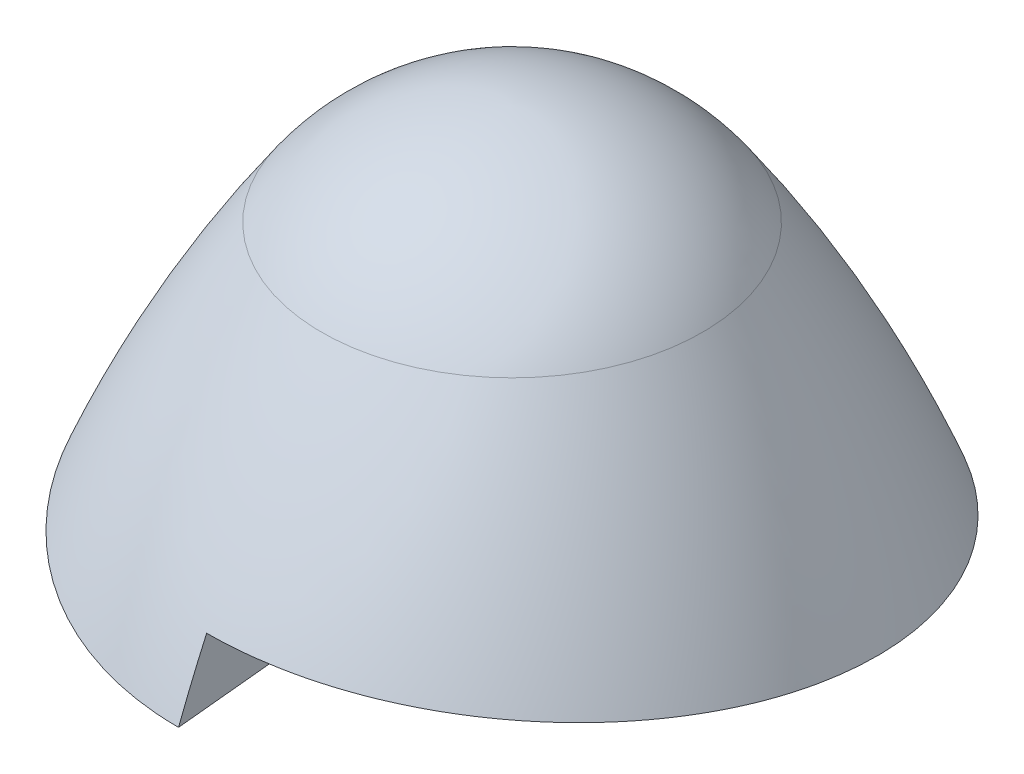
ISO-10303-21;
HEADER;
FILE_DESCRIPTION(('STEP AP214'),'2;1');
FILE_NAME('part.step','',(''),(''),'','','');
FILE_SCHEMA(('AUTOMOTIVE_DESIGN { 1 0 10303 214 1 1 1 1 }'));
ENDSEC;
DATA;
#1=APPLICATION_CONTEXT('core data for automotive mechanical design processes');
#2=APPLICATION_PROTOCOL_DEFINITION('international standard','automotive_design',2000,#1);
#3=PRODUCT_CONTEXT('',#1,'mechanical');
#4=PRODUCT('Part','Part','',(#3));
#5=PRODUCT_RELATED_PRODUCT_CATEGORY('part','',(#4));
#6=PRODUCT_DEFINITION_FORMATION('','',#4);
#7=PRODUCT_DEFINITION_CONTEXT('part definition',#1,'design');
#8=PRODUCT_DEFINITION('design','',#6,#7);
#9=PRODUCT_DEFINITION_SHAPE('','',#8);
#10=(LENGTH_UNIT() NAMED_UNIT(*) SI_UNIT(.MILLI.,.METRE.));
#11=(NAMED_UNIT(*) PLANE_ANGLE_UNIT() SI_UNIT($,.RADIAN.));
#12=(NAMED_UNIT(*) SI_UNIT($,.STERADIAN.) SOLID_ANGLE_UNIT());
#13=UNCERTAINTY_MEASURE_WITH_UNIT(LENGTH_MEASURE(1.E-05),#10,'distance_accuracy_value','');
#14=(GEOMETRIC_REPRESENTATION_CONTEXT(3) GLOBAL_UNCERTAINTY_ASSIGNED_CONTEXT((#13)) GLOBAL_UNIT_ASSIGNED_CONTEXT((#10,
#11,#12)) REPRESENTATION_CONTEXT('',''));
#15=CARTESIAN_POINT('',(0.,0.,0.));
#16=DIRECTION('',(0.,0.,1.));
#17=DIRECTION('',(1.,0.,0.));
#18=AXIS2_PLACEMENT_3D('',#15,#16,#17);
#19=CARTESIAN_POINT('',(-9.266041,1.92890931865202,-9.85234625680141));
#20=DIRECTION('',(0.,0.994521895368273,0.104528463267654));
#21=DIRECTION('',(0.,-0.104528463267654,0.994521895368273));
#22=AXIS2_PLACEMENT_3D('',#19,#20,#21);
#23=PLANE('',#22);
#24=CARTESIAN_POINT('',(0.,0.893385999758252,0.));
#25=DIRECTION('',(0.,0.994521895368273,0.104528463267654));
#26=DIRECTION('',(0.,-0.104528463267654,0.994521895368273));
#27=AXIS2_PLACEMENT_3D('',#24,#25,#26);
#28=ELLIPSE('',#27,5.68801378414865,5.65685424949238);
#29=CARTESIAN_POINT('',(-4.,1.31380294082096,-4.));
#30=VERTEX_POINT('',#29);
#31=CARTESIAN_POINT('',(0.,1.48794533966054,-5.65685424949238));
#32=VERTEX_POINT('',#31);
#33=EDGE_CURVE('E127',#30,#32,#28,.F.);
#34=ORIENTED_EDGE('',*,*,#33,.F.);
#35=DIRECTION('',(0.,0.104528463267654,-0.994521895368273));
#36=VECTOR('',#35,1.);
#37=CARTESIAN_POINT('',(-4.,1.92890931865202,-9.85234625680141));
#38=LINE('',#37,#36);
#39=CARTESIAN_POINT('',(-4.,0.472969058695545,4.));
#40=VERTEX_POINT('',#39);
#41=EDGE_CURVE('E11',#40,#30,#38,.T.);
#42=ORIENTED_EDGE('',*,*,#41,.F.);
#43=CARTESIAN_POINT('',(0.,0.893385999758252,0.));
#44=DIRECTION('',(0.,0.994521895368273,0.104528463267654));
#45=DIRECTION('',(0.,-0.104528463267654,0.994521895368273));
#46=AXIS2_PLACEMENT_3D('',#43,#44,#45);
#47=ELLIPSE('',#46,5.68801378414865,5.65685424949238);
#48=CARTESIAN_POINT('',(0.,0.298826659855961,5.65685424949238));
#49=VERTEX_POINT('',#48);
#50=EDGE_CURVE('E118',#49,#40,#47,.F.);
#51=ORIENTED_EDGE('',*,*,#50,.F.);
#52=DIRECTION('',(0.,-0.104528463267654,0.994521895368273));
#53=VECTOR('',#52,1.);
#54=CARTESIAN_POINT('',(0.,1.92890931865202,-9.85234625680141));
#55=LINE('',#54,#53);
#56=CARTESIAN_POINT('',(0.,0.,8.5));
#57=VERTEX_POINT('',#56);
#58=EDGE_CURVE('E195',#49,#57,#55,.T.);
#59=ORIENTED_EDGE('',*,*,#58,.T.);
#60=CARTESIAN_POINT('',(0.0002,1.71183513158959,-7.78702332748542));
#61=CARTESIAN_POINT('',(-0.234631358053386,1.71183870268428,-7.78705730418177));
#62=CARTESIAN_POINT('',(-0.469458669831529,1.71077045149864,-7.77689357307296));
#63=CARTESIAN_POINT('',(-0.937336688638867,1.70651167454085,-7.73637401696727));
#64=CARTESIAN_POINT('',(-1.17038746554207,1.70332123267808,-7.70601899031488));
#65=CARTESIAN_POINT('',(-1.63270380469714,1.69484418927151,-7.62536530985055));
#66=CARTESIAN_POINT('',(-1.86197331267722,1.6895599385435,-7.57508902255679));
#67=CARTESIAN_POINT('',(-2.31526854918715,1.67693709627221,-7.45499070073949));
#68=CARTESIAN_POINT('',(-2.53929447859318,1.66959858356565,-7.38516941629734));
#69=CARTESIAN_POINT('',(-2.97442483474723,1.65315067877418,-7.22867805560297));
#70=CARTESIAN_POINT('',(-3.18571499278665,1.64409491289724,-7.14251819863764));
#71=CARTESIAN_POINT('',(-3.60026596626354,1.62415842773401,-6.95283521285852));
#72=CARTESIAN_POINT('',(-3.80352672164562,1.6132776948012,-6.84931195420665));
#73=CARTESIAN_POINT('',(-4.20054358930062,1.5897726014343,-6.62567592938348));
#74=CARTESIAN_POINT('',(-4.39430170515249,1.57714861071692,-6.50556668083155));
#75=CARTESIAN_POINT('',(-4.77100396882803,1.55024617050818,-6.24960705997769));
#76=CARTESIAN_POINT('',(-4.95394809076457,1.53596771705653,-6.11375664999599));
#77=CARTESIAN_POINT('',(-5.30824125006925,1.50581669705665,-5.82688885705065));
#78=CARTESIAN_POINT('',(-5.47955649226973,1.48993979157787,-5.67583019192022));
#79=CARTESIAN_POINT('',(-5.80889205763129,1.45673347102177,-5.35989315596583));
#80=CARTESIAN_POINT('',(-5.96690775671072,1.43940355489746,-5.19501001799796));
#81=CARTESIAN_POINT('',(-6.26848004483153,1.40341988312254,-4.85264825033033));
#82=CARTESIAN_POINT('',(-6.41203668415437,1.38476613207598,-4.67516966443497));
#83=CARTESIAN_POINT('',(-6.68370168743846,1.34626707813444,-4.30887563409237));
#84=CARTESIAN_POINT('',(-6.81180973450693,1.32642175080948,-4.12005995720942));
#85=CARTESIAN_POINT('',(-7.05223003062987,1.28558910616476,-3.73156329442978));
#86=CARTESIAN_POINT('',(-7.16446899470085,1.264597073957,-3.53183744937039));
#87=CARTESIAN_POINT('',(-7.37169320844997,1.22170172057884,-3.12371542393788));
#88=CARTESIAN_POINT('',(-7.46667803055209,1.19979837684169,-2.91531902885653));
#89=CARTESIAN_POINT('',(-7.63871638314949,1.15524126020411,-2.49138638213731));
#90=CARTESIAN_POINT('',(-7.71577405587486,1.13258766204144,-2.27585179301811));
#91=CARTESIAN_POINT('',(-7.8514807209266,1.08667725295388,-1.83904342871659));
#92=CARTESIAN_POINT('',(-7.91012331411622,1.06342023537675,-1.6177676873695));
#93=CARTESIAN_POINT('',(-8.00874953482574,1.01638469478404,-1.17025441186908));
#94=CARTESIAN_POINT('',(-8.04866104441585,0.992604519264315,-0.944001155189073));
#95=CARTESIAN_POINT('',(-8.10922776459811,0.944769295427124,-0.488879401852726));
#96=CARTESIAN_POINT('',(-8.12987623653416,0.920714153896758,-0.260010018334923));
#97=CARTESIAN_POINT('',(-8.15174869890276,0.872510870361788,0.198613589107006));
#98=CARTESIAN_POINT('',(-8.1529753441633,0.848362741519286,0.428367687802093));
#99=CARTESIAN_POINT('',(-8.13600198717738,0.800141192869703,0.887165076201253));
#100=CARTESIAN_POINT('',(-8.11780197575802,0.776067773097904,1.11620836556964));
#101=CARTESIAN_POINT('',(-8.06204171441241,0.728116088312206,1.57243817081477));
#102=CARTESIAN_POINT('',(-8.02444111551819,0.704238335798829,1.79961981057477));
#103=CARTESIAN_POINT('',(-7.93013219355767,0.656906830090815,2.24994900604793));
#104=CARTESIAN_POINT('',(-7.8734300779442,0.633452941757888,2.47309784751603));
#105=CARTESIAN_POINT('',(-7.74129624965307,0.587124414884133,2.91388433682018));
#106=CARTESIAN_POINT('',(-7.6658612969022,0.564249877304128,3.13152102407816));
#107=CARTESIAN_POINT('',(-7.49679272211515,0.519248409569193,3.55968138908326));
#108=CARTESIAN_POINT('',(-7.40315953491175,0.497121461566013,3.77020523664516));
#109=CARTESIAN_POINT('',(-7.19845243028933,0.453795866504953,4.18242073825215));
#110=CARTESIAN_POINT('',(-7.08739670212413,0.432596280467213,4.38412132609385));
#111=CARTESIAN_POINT('',(-6.84855261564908,0.391253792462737,4.77746882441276));
#112=CARTESIAN_POINT('',(-6.72076458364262,0.371110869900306,4.96911593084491));
#113=CARTESIAN_POINT('',(-6.44933320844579,0.332024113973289,5.34100157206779));
#114=CARTESIAN_POINT('',(-6.30568781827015,0.313080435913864,5.52123862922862));
#115=CARTESIAN_POINT('',(-6.00362457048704,0.2765392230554,5.86890504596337));
#116=CARTESIAN_POINT('',(-5.84521228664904,0.258941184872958,6.03633919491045));
#117=CARTESIAN_POINT('',(-5.51525005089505,0.225268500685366,6.35671338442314));
#118=CARTESIAN_POINT('',(-5.34374629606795,0.209188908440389,6.50970048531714));
#119=CARTESIAN_POINT('',(-4.98840890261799,0.17860834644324,6.80065509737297));
#120=CARTESIAN_POINT('',(-4.80457963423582,0.164106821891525,6.93862788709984));
#121=CARTESIAN_POINT('',(-4.42574274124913,0.136774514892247,7.19867741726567));
#122=CARTESIAN_POINT('',(-4.23072935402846,0.123944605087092,7.32074585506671));
#123=CARTESIAN_POINT('',(-3.83100852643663,0.100058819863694,7.5480039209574));
#124=CARTESIAN_POINT('',(-3.62630142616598,0.0890028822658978,7.65319414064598));
#125=CARTESIAN_POINT('',(-3.20945529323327,0.0687847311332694,7.84555699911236));
#126=CARTESIAN_POINT('',(-2.9973477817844,0.0596154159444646,7.93279720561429));
#127=CARTESIAN_POINT('',(-2.56647752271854,0.0431847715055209,8.08912434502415));
#128=CARTESIAN_POINT('',(-2.34771495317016,0.0359233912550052,8.15821176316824));
#129=CARTESIAN_POINT('',(-1.90541130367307,0.0233704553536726,8.27764497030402));
#130=CARTESIAN_POINT('',(-1.68187730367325,0.0180761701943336,8.32801672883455));
#131=CARTESIAN_POINT('',(-1.2314179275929,0.00948413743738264,8.40976445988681));
#132=CARTESIAN_POINT('',(-1.00449436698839,0.00618535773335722,8.4411502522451));
#133=CARTESIAN_POINT('',(-0.647494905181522,0.0025962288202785,8.47529853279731));
#134=CARTESIAN_POINT('',(-0.518015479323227,0.00162173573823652,8.48457021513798));
#135=CARTESIAN_POINT('',(-0.258962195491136,0.000323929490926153,8.49691801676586));
#136=CARTESIAN_POINT('',(-0.129388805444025,-4.04290098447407E-07,8.50000384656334));
#137=CARTESIAN_POINT('',(0.000200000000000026,2.57689258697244E-10,8.49999999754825));
#138=B_SPLINE_CURVE_WITH_KNOTS('',3,(#60,#61,#62,#63,#64,#65,#66,#67,#68,#69,#70,#71,#72,#73,
#74,#75,#76,#77,#78,#79,#80,#81,#82,#83,#84,#85,#86,#87,#88,#89,#90,#91,#92,#93,#94,#95,#96,#97,
#98,#99,#100,#101,#102,#103,#104,#105,#106,#107,#108,#109,#110,#111,#112,#113,#114,#115,#116,
#117,#118,#119,#120,#121,#122,#123,#124,#125,#126,#127,#128,#129,#130,#131,#132,#133,#134,#135,
#136,#137),.UNSPECIFIED.,.F.,.F.,(4,2,2,2,2,2,2,2,2,2,2,2,2,2,2,2,2,2,2,2,2,2,2,2,2,2,2,2,2,2,2,
2,2,2,2,2,2,2,4),(0.,0.704265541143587,1.40850323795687,2.11195248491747,2.8153747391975,
3.49965452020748,4.18393941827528,4.86807941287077,5.55222104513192,6.23827256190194,
6.92456163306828,7.61084831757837,8.29714907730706,8.98652238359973,9.67591277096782,
10.3651437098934,11.0546138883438,11.7467172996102,12.4390627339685,13.1313135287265,
13.8235646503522,14.5172613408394,15.2107328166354,15.9043243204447,16.5978992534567,
17.2907548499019,17.9835969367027,18.6765285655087,19.3691996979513,20.0595304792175,
20.7496177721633,21.4400638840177,22.1304857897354,22.8182592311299,23.5060142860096,
24.1928114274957,24.8792530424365,25.2685629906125,25.6572613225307),.UNSPECIFIED.);
#139=CARTESIAN_POINT('',(0.,1.71183513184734,-7.78702332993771));
#140=VERTEX_POINT('',#139);
#141=EDGE_CURVE('E158',#140,#57,#138,.T.);
#142=ORIENTED_EDGE('',*,*,#141,.F.);
#143=EDGE_CURVE('E190',#140,#32,#55,.T.);
#144=ORIENTED_EDGE('',*,*,#143,.T.);
#145=EDGE_LOOP('',(#34,#42,#51,#59,#142,#144));
#146=FACE_BOUND('',#145,.T.);
#147=ADVANCED_FACE('F27',(#146),#23,.F.);
#148=CARTESIAN_POINT('',(0.,1.92890931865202,-9.85234625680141));
#149=DIRECTION('',(1.,0.,0.));
#150=DIRECTION('',(0.,0.,-1.));
#151=AXIS2_PLACEMENT_3D('',#148,#149,#150);
#152=PLANE('',#151);
#153=DIRECTION('',(0.,-1.,0.));
#154=VECTOR('',#153,1.);
#155=CARTESIAN_POINT('',(0.,5.,-5.65685424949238));
#156=LINE('',#155,#154);
#157=CARTESIAN_POINT('',(0.,0.307805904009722,-5.65685424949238));
#158=VERTEX_POINT('',#157);
#159=EDGE_CURVE('E125',#32,#158,#156,.T.);
#160=ORIENTED_EDGE('',*,*,#159,.F.);
#161=ORIENTED_EDGE('',*,*,#143,.F.);
#162=CARTESIAN_POINT('',(0.,-11.6322228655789,21.8401307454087));
#163=DIRECTION('',(1.,0.,0.));
#164=DIRECTION('',(0.,0.,-1.));
#165=AXIS2_PLACEMENT_3D('',#162,#163,#164);
#166=CIRCLE('',#165,32.4935707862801);
#167=CARTESIAN_POINT('',(0.,0.00935644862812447,-8.49641113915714));
#168=VERTEX_POINT('',#167);
#169=EDGE_CURVE('E50',#168,#140,#166,.T.);
#170=ORIENTED_EDGE('',*,*,#169,.F.);
#171=DIRECTION('',(0.,0.104528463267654,0.994521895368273));
#172=VECTOR('',#171,1.);
#173=CARTESIAN_POINT('',(0.,-0.110627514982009,-9.63798229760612));
#174=LINE('',#173,#172);
#175=EDGE_CURVE('E164',#168,#158,#174,.T.);
#176=ORIENTED_EDGE('',*,*,#175,.T.);
#177=EDGE_LOOP('',(#160,#161,#170,#176));
#178=FACE_BOUND('',#177,.T.);
#179=ADVANCED_FACE('F152',(#178),#152,.F.);
#180=CARTESIAN_POINT('',(0.,-3.85084979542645,-9.65034217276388));
#181=DIRECTION('',(-1.,0.,0.));
#182=DIRECTION('',(0.,-1.,0.));
#183=AXIS2_PLACEMENT_3D('',#180,#181,#182);
#184=PLANE('',#183);
#185=DIRECTION('',(0.,-1.,0.));
#186=VECTOR('',#185,1.);
#187=CARTESIAN_POINT('',(0.,5.,5.65685424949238));
#188=LINE('',#187,#186);
#189=CARTESIAN_POINT('',(0.,1.4969245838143,5.65685424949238));
#190=VERTEX_POINT('',#189);
#191=EDGE_CURVE('E115',#190,#49,#188,.T.);
#192=ORIENTED_EDGE('',*,*,#191,.F.);
#193=DIRECTION('',(0.,0.104528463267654,0.994521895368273));
#194=VECTOR('',#193,1.);
#195=CARTESIAN_POINT('',(0.,-0.152778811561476,-10.0390250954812));
#196=LINE('',#195,#194);
#197=CARTESIAN_POINT('',(0.,1.72040837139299,7.78316045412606));
#198=VERTEX_POINT('',#197);
#199=EDGE_CURVE('E129',#190,#198,#196,.T.);
#200=ORIENTED_EDGE('',*,*,#199,.T.);
#201=CARTESIAN_POINT('',(0.,-11.6322228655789,-21.8401307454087));
#202=DIRECTION('',(-1.,0.,0.));
#203=DIRECTION('',(0.,-1.,0.));
#204=AXIS2_PLACEMENT_3D('',#201,#202,#203);
#205=CIRCLE('',#204,32.4935707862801);
#206=EDGE_CURVE('E137',#57,#198,#205,.T.);
#207=ORIENTED_EDGE('',*,*,#206,.F.);
#208=ORIENTED_EDGE('',*,*,#58,.F.);
#209=EDGE_LOOP('',(#192,#200,#207,#208));
#210=FACE_BOUND('',#209,.T.);
#211=ADVANCED_FACE('F147',(#210),#184,.F.);
#212=CARTESIAN_POINT('',(0.,-0.152778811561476,-10.0390250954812));
#213=DIRECTION('',(0.,0.994521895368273,-0.104528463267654));
#214=DIRECTION('',(0.,0.104528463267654,0.994521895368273));
#215=AXIS2_PLACEMENT_3D('',#212,#213,#214);
#216=PLANE('',#215);
#217=CARTESIAN_POINT('',(0.,0.902365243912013,0.));
#218=DIRECTION('',(0.,0.994521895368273,-0.104528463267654));
#219=DIRECTION('',(0.,-0.104528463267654,-0.994521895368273));
#220=AXIS2_PLACEMENT_3D('',#217,#218,#219);
#221=ELLIPSE('',#220,5.68801378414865,5.65685424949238);
#222=CARTESIAN_POINT('',(4.,0.481948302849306,-4.));
#223=VERTEX_POINT('',#222);
#224=EDGE_CURVE('E35',#158,#223,#221,.F.);
#225=ORIENTED_EDGE('',*,*,#224,.F.);
#226=ORIENTED_EDGE('',*,*,#175,.F.);
#227=CARTESIAN_POINT('',(-0.000199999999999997,1.72040837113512,7.78316045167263));
#228=CARTESIAN_POINT('',(0.234468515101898,1.72041193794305,7.78319438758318));
#229=CARTESIAN_POINT('',(0.469132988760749,1.71934467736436,7.77304008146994));
#230=CARTESIAN_POINT('',(0.936687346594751,1.71508984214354,7.73255802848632));
#231=CARTESIAN_POINT('',(1.16957730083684,1.71190235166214,7.70223108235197));
#232=CARTESIAN_POINT('',(1.63157679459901,1.70343312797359,7.6216518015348));
#233=CARTESIAN_POINT('',(1.86069026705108,1.69815373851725,7.57142176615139));
#234=CARTESIAN_POINT('',(2.31367948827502,1.68554247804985,7.4514336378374));
#235=CARTESIAN_POINT('',(2.53755543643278,1.67821068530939,7.38167628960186));
#236=CARTESIAN_POINT('',(2.97244699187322,1.66177593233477,7.22531006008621));
#237=CARTESIAN_POINT('',(3.18364661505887,1.65272611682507,7.13920681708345));
#238=CARTESIAN_POINT('',(3.59802163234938,1.63280230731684,6.94964443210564));
#239=CARTESIAN_POINT('',(3.80119696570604,1.62192829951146,6.8461851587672));
#240=CARTESIAN_POINT('',(4.19804879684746,1.59843737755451,6.62268396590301));
#241=CARTESIAN_POINT('',(4.39172729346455,1.585820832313,6.50264555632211));
#242=CARTESIAN_POINT('',(4.76827657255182,1.55893395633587,6.24683401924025));
#243=CARTESIAN_POINT('',(4.95114732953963,1.54466362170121,6.11106085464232));
#244=CARTESIAN_POINT('',(5.3053003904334,1.5145294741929,5.82435359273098));
#245=CARTESIAN_POINT('',(5.4765489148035,1.49866132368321,5.67337822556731));
#246=CARTESIAN_POINT('',(5.8057583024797,1.46547307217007,5.35761310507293));
#247=CARTESIAN_POINT('',(5.96371454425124,1.44815247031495,5.1928185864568));
#248=CARTESIAN_POINT('',(6.26517560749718,1.41218791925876,4.85063874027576));
#249=CARTESIAN_POINT('',(6.40868048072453,1.39354397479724,4.67325345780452));
#250=CARTESIAN_POINT('',(6.68025002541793,1.35506495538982,4.30715004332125));
#251=CARTESIAN_POINT('',(6.80831438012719,1.33522985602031,4.11843167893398));
#252=CARTESIAN_POINT('',(7.04865569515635,1.29441802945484,3.73013308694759));
#253=CARTESIAN_POINT('',(7.16085938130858,1.27343658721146,3.53050799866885));
#254=CARTESIAN_POINT('',(7.36802169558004,1.23056268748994,3.12259009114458));
#255=CARTESIAN_POINT('',(7.46297989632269,1.20867020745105,2.91429705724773));
#256=CARTESIAN_POINT('',(7.63497386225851,1.16413501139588,2.49057297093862));
#257=CARTESIAN_POINT('',(7.71201376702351,1.1414924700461,2.27514358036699));
#258=CARTESIAN_POINT('',(7.84769386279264,1.09560429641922,1.83854677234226));
#259=CARTESIAN_POINT('',(7.90632765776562,1.07235845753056,1.61737738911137));
#260=CARTESIAN_POINT('',(8.00494540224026,1.02534531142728,1.17007718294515));
#261=CARTESIAN_POINT('',(8.04485723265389,1.00157635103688,0.94393063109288));
#262=CARTESIAN_POINT('',(8.10543363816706,0.953763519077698,0.489021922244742));
#263=CARTESIAN_POINT('',(8.12609147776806,0.929719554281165,0.260258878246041));
#264=CARTESIAN_POINT('',(8.14799165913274,0.881538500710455,-0.198153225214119));
#265=CARTESIAN_POINT('',(8.14923665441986,0.85740142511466,-0.427802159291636));
#266=CARTESIAN_POINT('',(8.13230885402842,0.809201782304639,-0.886391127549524));
#267=CARTESIAN_POINT('',(8.11413604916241,0.785139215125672,-1.11533116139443));
#268=CARTESIAN_POINT('',(8.05843889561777,0.737208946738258,-1.57135720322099));
#269=CARTESIAN_POINT('',(8.02087418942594,0.713341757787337,-1.79843833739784));
#270=CARTESIAN_POINT('',(7.92664543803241,0.666031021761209,-2.24856992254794));
#271=CARTESIAN_POINT('',(7.86998759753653,0.642587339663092,-2.47162165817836));
#272=CARTESIAN_POINT('',(7.7379504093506,0.596278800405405,-2.91221797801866));
#273=CARTESIAN_POINT('',(7.66256782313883,0.573414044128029,-3.12976160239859));
#274=CARTESIAN_POINT('',(7.49361169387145,0.528431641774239,-3.55774057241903));
#275=CARTESIAN_POINT('',(7.40003858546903,0.506313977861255,-3.76817608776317));
#276=CARTESIAN_POINT('',(7.19545883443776,0.463006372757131,-4.18022042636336));
#277=CARTESIAN_POINT('',(7.08447036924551,0.441815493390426,-4.38183817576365));
#278=CARTESIAN_POINT('',(6.84576759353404,0.400489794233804,-4.77502593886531));
#279=CARTESIAN_POINT('',(6.71805360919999,0.380354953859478,-4.96659614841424));
#280=CARTESIAN_POINT('',(6.44677659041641,0.341283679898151,-5.33833448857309));
#281=CARTESIAN_POINT('',(6.30321150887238,0.322347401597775,-5.51850114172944));
#282=CARTESIAN_POINT('',(6.00131453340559,0.285820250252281,-5.86603377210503));
#283=CARTESIAN_POINT('',(5.8429882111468,0.268228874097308,-6.03340453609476));
#284=CARTESIAN_POINT('',(5.51320280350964,0.234568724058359,-6.35365947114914));
#285=CARTESIAN_POINT('',(5.34178990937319,0.218495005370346,-6.50659068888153));
#286=CARTESIAN_POINT('',(4.98663861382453,0.187925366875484,-6.79744137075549));
#287=CARTESIAN_POINT('',(4.80290458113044,0.173428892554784,-6.93536611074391));
#288=CARTESIAN_POINT('',(4.42426198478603,0.146105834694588,-7.19532764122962));
#289=CARTESIAN_POINT('',(4.22934766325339,0.133280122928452,-7.31735613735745));
#290=CARTESIAN_POINT('',(3.82982798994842,0.109401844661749,-7.5445427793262));
#291=CARTESIAN_POINT('',(3.62522297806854,0.098349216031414,-7.64970151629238));
#292=CARTESIAN_POINT('',(3.20858334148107,0.07813677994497,-7.84200999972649));
#293=CARTESIAN_POINT('',(2.99658024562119,0.0689698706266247,-7.92922731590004));
#294=CARTESIAN_POINT('',(2.56592038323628,0.0525431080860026,-8.08551752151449));
#295=CARTESIAN_POINT('',(2.34726379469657,0.0452832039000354,-8.15459089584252));
#296=CARTESIAN_POINT('',(1.9051725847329,0.0327322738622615,-8.27400501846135));
#297=CARTESIAN_POINT('',(1.68174503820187,0.0274385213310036,-8.3243717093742));
#298=CARTESIAN_POINT('',(1.23149855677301,0.0188466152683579,-8.40611823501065));
#299=CARTESIAN_POINT('',(1.00468143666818,0.0155474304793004,-8.43750788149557));
#300=CARTESIAN_POINT('',(0.647739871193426,0.0119558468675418,-8.47167951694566));
#301=CARTESIAN_POINT('',(0.518211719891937,0.0109801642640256,-8.48096251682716));
#302=CARTESIAN_POINT('',(0.259060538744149,0.00968077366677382,-8.4933253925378));
#303=CARTESIAN_POINT('',(0.129437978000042,0.00935604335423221,-8.49641499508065));
#304=CARTESIAN_POINT('',(-0.000199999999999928,0.00935644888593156,-8.49641113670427));
#305=B_SPLINE_CURVE_WITH_KNOTS('',3,(#227,#228,#229,#230,#231,#232,#233,#234,#235,#236,#237,
#238,#239,#240,#241,#242,#243,#244,#245,#246,#247,#248,#249,#250,#251,#252,#253,#254,#255,#256,
#257,#258,#259,#260,#261,#262,#263,#264,#265,#266,#267,#268,#269,#270,#271,#272,#273,#274,#275,
#276,#277,#278,#279,#280,#281,#282,#283,#284,#285,#286,#287,#288,#289,#290,#291,#292,#293,#294,
#295,#296,#297,#298,#299,#300,#301,#302,#303,#304),.UNSPECIFIED.,.F.,.F.,(4,2,2,2,2,2,2,2,2,2,2,
2,2,2,2,2,2,2,2,2,2,2,2,2,2,2,2,2,2,2,2,2,2,2,2,2,2,2,4),(0.,0.703777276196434,1.40752661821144,
2.11048970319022,2.81342598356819,3.49739001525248,4.18135922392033,4.86518385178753,
5.5490100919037,6.23474552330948,6.92071839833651,7.60668881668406,8.29267330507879,
8.98173004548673,9.67080385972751,10.3597183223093,11.0488719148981,11.7406588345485,
12.4326876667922,13.1246219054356,13.8165564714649,14.5099368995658,15.2030922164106,
15.896367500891,16.5896262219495,17.2821661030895,17.9746924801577,18.6673083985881,
19.3596639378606,20.049679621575,20.7394519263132,21.4295827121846,22.1196893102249,
22.807147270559,23.4945868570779,24.1810695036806,24.8671969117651,25.256654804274,
25.64550057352),.UNSPECIFIED.);
#306=EDGE_CURVE('E131',#198,#168,#305,.T.);
#307=ORIENTED_EDGE('',*,*,#306,.F.);
#308=ORIENTED_EDGE('',*,*,#199,.F.);
#309=CARTESIAN_POINT('',(0.,0.902365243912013,0.));
#310=DIRECTION('',(0.,0.994521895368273,-0.104528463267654));
#311=DIRECTION('',(0.,-0.104528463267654,-0.994521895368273));
#312=AXIS2_PLACEMENT_3D('',#309,#310,#311);
#313=ELLIPSE('',#312,5.68801378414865,5.65685424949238);
#314=CARTESIAN_POINT('',(4.,1.32278218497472,4.));
#315=VERTEX_POINT('',#314);
#316=EDGE_CURVE('E170',#315,#190,#313,.F.);
#317=ORIENTED_EDGE('',*,*,#316,.F.);
#318=DIRECTION('',(0.,0.104528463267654,0.994521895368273));
#319=VECTOR('',#318,1.);
#320=CARTESIAN_POINT('',(4.,-0.152778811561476,-10.0390250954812));
#321=LINE('',#320,#319);
#322=EDGE_CURVE('E168',#223,#315,#321,.T.);
#323=ORIENTED_EDGE('',*,*,#322,.F.);
#324=EDGE_LOOP('',(#225,#226,#307,#308,#317,#323));
#325=FACE_BOUND('',#324,.T.);
#326=ADVANCED_FACE('F142',(#325),#216,.F.);
#327=CARTESIAN_POINT('',(0.127035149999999,3.43855303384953,0.));
#328=DIRECTION('',(0.,0.,-1.));
#329=DIRECTION('',(-1.,0.,0.));
#330=AXIS2_PLACEMENT_3D('',#327,#328,#329);
#331=CIRCLE('',#330,6.06277801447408);
#332=TRIMMED_CURVE('',#331,(PARAMETER_VALUE(-1.54984150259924)),
(PARAMETER_VALUE(1.54984150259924)),.T.,.PARAMETER.);
#333=CARTESIAN_POINT('',(0.,3.43855303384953,0.));
#334=DIRECTION('',(0.,1.,0.));
#335=AXIS1_PLACEMENT('',#333,#334);
#336=SURFACE_OF_REVOLUTION('',#332,#335);
#337=CARTESIAN_POINT('',(0.,9.5,0.));
#338=VERTEX_POINT('',#337);
#339=VERTEX_LOOP('',#338);
#340=FACE_BOUND('',#339,.T.);
#341=CARTESIAN_POINT('',(0.,6.89553480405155,0.));
#342=DIRECTION('',(0.,1.,0.));
#343=DIRECTION('',(-1.,0.,0.));
#344=AXIS2_PLACEMENT_3D('',#341,#342,#343);
#345=CIRCLE('',#344,4.8535827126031);
#346=CARTESIAN_POINT('',(-4.8535827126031,6.89553480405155,0.));
#347=VERTEX_POINT('',#346);
#348=EDGE_CURVE('E196',#347,#347,#345,.T.);
#349=ORIENTED_EDGE('',*,*,#348,.T.);
#350=EDGE_LOOP('',(#349));
#351=FACE_BOUND('',#350,.T.);
#352=ADVANCED_FACE('F29',(#340,#351),#336,.T.);
#353=CARTESIAN_POINT('',(0.,-11.6322228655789,0.));
#354=DIRECTION('',(0.,1.,0.));
#355=DIRECTION('',(-1.,0.,0.));
#356=AXIS2_PLACEMENT_3D('',#353,#354,#355);
#357=DEGENERATE_TOROIDAL_SURFACE('',#356,21.8401307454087,32.4935707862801,.F.);
#358=ORIENTED_EDGE('',*,*,#348,.F.);
#359=EDGE_LOOP('',(#358));
#360=FACE_BOUND('',#359,.T.);
#361=ORIENTED_EDGE('',*,*,#141,.T.);
#362=ORIENTED_EDGE('',*,*,#206,.T.);
#363=ORIENTED_EDGE('',*,*,#306,.T.);
#364=ORIENTED_EDGE('',*,*,#169,.T.);
#365=EDGE_LOOP('',(#361,#362,#363,#364));
#366=FACE_BOUND('',#365,.T.);
#367=ADVANCED_FACE('F139',(#360,#366),#357,.F.);
#368=CARTESIAN_POINT('',(-4.,5.,4.));
#369=DIRECTION('',(1.,0.,0.));
#370=DIRECTION('',(0.,0.,-1.));
#371=AXIS2_PLACEMENT_3D('',#368,#369,#370);
#372=PLANE('',#371);
#373=ORIENTED_EDGE('',*,*,#41,.T.);
#374=DIRECTION('',(0.,-1.,0.));
#375=VECTOR('',#374,1.);
#376=CARTESIAN_POINT('',(-4.,5.,-4.));
#377=LINE('',#376,#375);
#378=CARTESIAN_POINT('',(-4.,5.,-4.));
#379=VERTEX_POINT('',#378);
#380=EDGE_CURVE('E110',#379,#30,#377,.T.);
#381=ORIENTED_EDGE('',*,*,#380,.F.);
#382=DIRECTION('',(0.,0.,1.));
#383=VECTOR('',#382,1.);
#384=CARTESIAN_POINT('',(-4.,5.,4.));
#385=LINE('',#384,#383);
#386=CARTESIAN_POINT('',(-4.,5.,4.));
#387=VERTEX_POINT('',#386);
#388=EDGE_CURVE('E96',#379,#387,#385,.T.);
#389=ORIENTED_EDGE('',*,*,#388,.T.);
#390=DIRECTION('',(0.,-1.,0.));
#391=VECTOR('',#390,1.);
#392=CARTESIAN_POINT('',(-4.,5.,4.));
#393=LINE('',#392,#391);
#394=EDGE_CURVE('E116',#387,#40,#393,.T.);
#395=ORIENTED_EDGE('',*,*,#394,.T.);
#396=EDGE_LOOP('',(#373,#381,#389,#395));
#397=FACE_BOUND('',#396,.T.);
#398=ADVANCED_FACE('F113',(#397),#372,.T.);
#399=CARTESIAN_POINT('',(0.,5.,0.));
#400=DIRECTION('',(0.,-1.,0.));
#401=DIRECTION('',(0.,0.,-1.));
#402=AXIS2_PLACEMENT_3D('',#399,#400,#401);
#403=CYLINDRICAL_SURFACE('',#402,5.65685424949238);
#404=ORIENTED_EDGE('',*,*,#33,.T.);
#405=ORIENTED_EDGE('',*,*,#159,.T.);
#406=ORIENTED_EDGE('',*,*,#224,.T.);
#407=DIRECTION('',(0.,-1.,0.));
#408=VECTOR('',#407,1.);
#409=CARTESIAN_POINT('',(4.,5.,-4.));
#410=LINE('',#409,#408);
#411=CARTESIAN_POINT('',(4.,5.,-4.));
#412=VERTEX_POINT('',#411);
#413=EDGE_CURVE('E42',#412,#223,#410,.T.);
#414=ORIENTED_EDGE('',*,*,#413,.F.);
#415=CARTESIAN_POINT('',(0.,5.,0.));
#416=DIRECTION('',(0.,1.,0.));
#417=DIRECTION('',(0.,0.,-1.));
#418=AXIS2_PLACEMENT_3D('',#415,#416,#417);
#419=CIRCLE('',#418,5.65685424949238);
#420=EDGE_CURVE('E100',#412,#379,#419,.T.);
#421=ORIENTED_EDGE('',*,*,#420,.T.);
#422=ORIENTED_EDGE('',*,*,#380,.T.);
#423=EDGE_LOOP('',(#404,#405,#406,#414,#421,#422));
#424=FACE_BOUND('',#423,.T.);
#425=ADVANCED_FACE('F109',(#424),#403,.F.);
#426=CARTESIAN_POINT('',(0.,5.,0.));
#427=DIRECTION('',(0.,-1.,0.));
#428=DIRECTION('',(0.,0.,-1.));
#429=AXIS2_PLACEMENT_3D('',#426,#427,#428);
#430=CYLINDRICAL_SURFACE('',#429,5.65685424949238);
#431=ORIENTED_EDGE('',*,*,#50,.T.);
#432=ORIENTED_EDGE('',*,*,#394,.F.);
#433=CARTESIAN_POINT('',(0.,5.,0.));
#434=DIRECTION('',(0.,1.,0.));
#435=DIRECTION('',(0.,0.,-1.));
#436=AXIS2_PLACEMENT_3D('',#433,#434,#435);
#437=CIRCLE('',#436,5.65685424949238);
#438=CARTESIAN_POINT('',(4.,5.,4.));
#439=VERTEX_POINT('',#438);
#440=EDGE_CURVE('E101',#387,#439,#437,.T.);
#441=ORIENTED_EDGE('',*,*,#440,.T.);
#442=DIRECTION('',(0.,-1.,0.));
#443=VECTOR('',#442,1.);
#444=CARTESIAN_POINT('',(4.,5.,4.));
#445=LINE('',#444,#443);
#446=EDGE_CURVE('E120',#439,#315,#445,.T.);
#447=ORIENTED_EDGE('',*,*,#446,.T.);
#448=ORIENTED_EDGE('',*,*,#316,.T.);
#449=ORIENTED_EDGE('',*,*,#191,.T.);
#450=EDGE_LOOP('',(#431,#432,#441,#447,#448,#449));
#451=FACE_BOUND('',#450,.T.);
#452=ADVANCED_FACE('F180',(#451),#430,.F.);
#453=CARTESIAN_POINT('',(4.,5.,-4.));
#454=DIRECTION('',(-1.,0.,0.));
#455=DIRECTION('',(0.,0.,1.));
#456=AXIS2_PLACEMENT_3D('',#453,#454,#455);
#457=PLANE('',#456);
#458=ORIENTED_EDGE('',*,*,#322,.T.);
#459=ORIENTED_EDGE('',*,*,#446,.F.);
#460=DIRECTION('',(0.,0.,-1.));
#461=VECTOR('',#460,1.);
#462=CARTESIAN_POINT('',(4.,5.,-4.));
#463=LINE('',#462,#461);
#464=EDGE_CURVE('E182',#439,#412,#463,.T.);
#465=ORIENTED_EDGE('',*,*,#464,.T.);
#466=ORIENTED_EDGE('',*,*,#413,.T.);
#467=EDGE_LOOP('',(#458,#459,#465,#466));
#468=FACE_BOUND('',#467,.T.);
#469=ADVANCED_FACE('F178',(#468),#457,.T.);
#470=CARTESIAN_POINT('',(0.,5.,0.));
#471=DIRECTION('',(0.,-1.,0.));
#472=DIRECTION('',(0.,0.,-1.));
#473=AXIS2_PLACEMENT_3D('',#470,#471,#472);
#474=PLANE('',#473);
#475=ORIENTED_EDGE('',*,*,#420,.F.);
#476=ORIENTED_EDGE('',*,*,#464,.F.);
#477=ORIENTED_EDGE('',*,*,#440,.F.);
#478=ORIENTED_EDGE('',*,*,#388,.F.);
#479=EDGE_LOOP('',(#475,#476,#477,#478));
#480=FACE_BOUND('',#479,.T.);
#481=ADVANCED_FACE('F98',(#480),#474,.T.);
#482=CLOSED_SHELL('',(#147,#179,#211,#326,#352,#367,#398,#425,#452,#469,#481));
#483=MANIFOLD_SOLID_BREP('B2',#482);
#484=ADVANCED_BREP_SHAPE_REPRESENTATION('',(#18,#483),#14);
#485=SHAPE_DEFINITION_REPRESENTATION(#9,#484);
ENDSEC;
END-ISO-10303-21;
